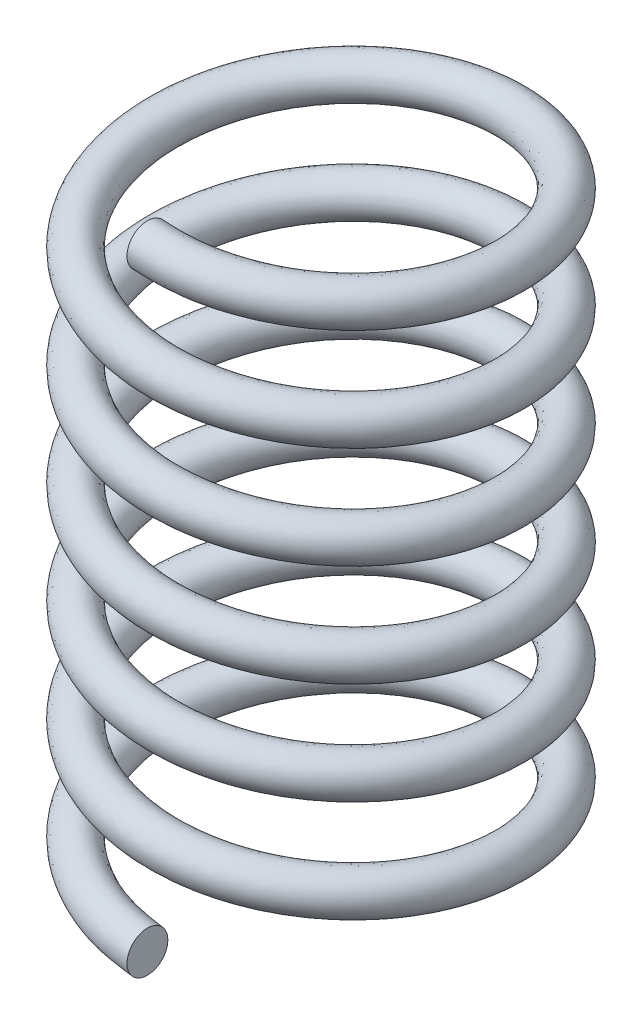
from build123d import *

# Parameters (mm, degrees)
BASE_BALAYAGE_PITCH  = 2.5
BASE_BALAYAGE_HEIGHT = 15
BASE_BALAYAGE_RADIUS = 4.25
ESQUISSE2_R          = 0.5


with BuildPart() as part:
    # Base-Balayage: sweep along a helix
    with BuildLine() as base_balayage_path:
        Helix(BASE_BALAYAGE_PITCH, BASE_BALAYAGE_HEIGHT, BASE_BALAYAGE_RADIUS, center=(0, 0, 0), direction=(0, 1, 0), lefthand=True)
    # Esquisse2 → Base-Balayage (sweep)
    with BuildSketch(Plane(origin=(0, 0, 0), x_dir=(0, 0, -1), z_dir=(1, 0, 0))):
        with Locations((-4.25, 15)):
            Circle(ESQUISSE2_R)
    sweep(path=base_balayage_path.line, is_frenet=True)


solid = part.part
